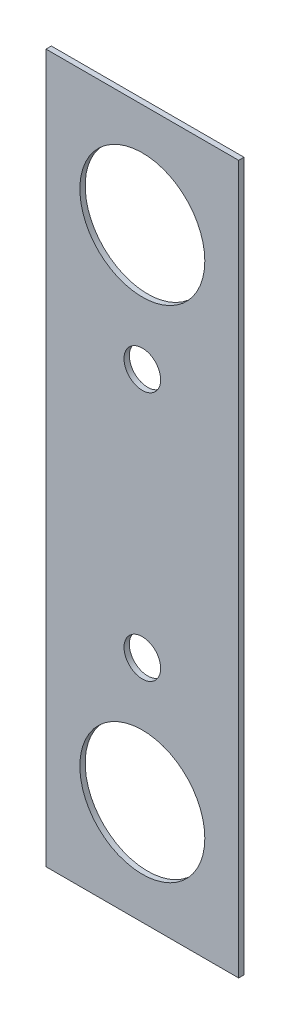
ISO-10303-21;
HEADER;
FILE_DESCRIPTION(('STEP AP214'),'2;1');
FILE_NAME('part.step','',(''),(''),'','','');
FILE_SCHEMA(('AUTOMOTIVE_DESIGN { 1 0 10303 214 1 1 1 1 }'));
ENDSEC;
DATA;
#1=APPLICATION_CONTEXT('core data for automotive mechanical design processes');
#2=APPLICATION_PROTOCOL_DEFINITION('international standard','automotive_design',2000,#1);
#3=PRODUCT_CONTEXT('',#1,'mechanical');
#4=PRODUCT('Part','Part','',(#3));
#5=PRODUCT_RELATED_PRODUCT_CATEGORY('part','',(#4));
#6=PRODUCT_DEFINITION_FORMATION('','',#4);
#7=PRODUCT_DEFINITION_CONTEXT('part definition',#1,'design');
#8=PRODUCT_DEFINITION('design','',#6,#7);
#9=PRODUCT_DEFINITION_SHAPE('','',#8);
#10=(LENGTH_UNIT() NAMED_UNIT(*) SI_UNIT(.MILLI.,.METRE.));
#11=(NAMED_UNIT(*) PLANE_ANGLE_UNIT() SI_UNIT($,.RADIAN.));
#12=(NAMED_UNIT(*) SI_UNIT($,.STERADIAN.) SOLID_ANGLE_UNIT());
#13=UNCERTAINTY_MEASURE_WITH_UNIT(LENGTH_MEASURE(1.E-05),#10,'distance_accuracy_value','');
#14=(GEOMETRIC_REPRESENTATION_CONTEXT(3) GLOBAL_UNCERTAINTY_ASSIGNED_CONTEXT((#13)) GLOBAL_UNIT_ASSIGNED_CONTEXT((#10,
#11,#12)) REPRESENTATION_CONTEXT('',''));
#15=CARTESIAN_POINT('',(0.,0.,0.));
#16=DIRECTION('',(0.,0.,1.));
#17=DIRECTION('',(1.,0.,0.));
#18=AXIS2_PLACEMENT_3D('',#15,#16,#17);
#19=CARTESIAN_POINT('',(14.6843750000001,-53.975,0.812800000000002));
#20=DIRECTION('',(0.,0.,1.));
#21=DIRECTION('',(1.,0.,0.));
#22=AXIS2_PLACEMENT_3D('',#19,#20,#21);
#23=PLANE('',#22);
#24=CARTESIAN_POINT('',(0.,19.05,0.812800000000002));
#25=DIRECTION('',(0.,0.,1.));
#26=DIRECTION('',(1.,0.,0.));
#27=AXIS2_PLACEMENT_3D('',#24,#25,#26);
#28=CIRCLE('',#27,2.794);
#29=CARTESIAN_POINT('',(2.794,19.05,0.812800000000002));
#30=VERTEX_POINT('',#29);
#31=EDGE_CURVE('E122',#30,#30,#28,.T.);
#32=ORIENTED_EDGE('',*,*,#31,.F.);
#33=EDGE_LOOP('',(#32));
#34=FACE_BOUND('',#33,.T.);
#35=CARTESIAN_POINT('',(0.,-38.1,0.812800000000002));
#36=DIRECTION('',(0.,0.,1.));
#37=DIRECTION('',(1.,0.,0.));
#38=AXIS2_PLACEMENT_3D('',#35,#36,#37);
#39=CIRCLE('',#38,9.525);
#40=CARTESIAN_POINT('',(9.525,-38.1,0.812800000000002));
#41=VERTEX_POINT('',#40);
#42=EDGE_CURVE('E101',#41,#41,#39,.T.);
#43=ORIENTED_EDGE('',*,*,#42,.F.);
#44=EDGE_LOOP('',(#43));
#45=FACE_BOUND('',#44,.T.);
#46=DIRECTION('',(1.,0.,0.));
#47=VECTOR('',#46,1.);
#48=CARTESIAN_POINT('',(-14.6843750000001,-53.975,0.812800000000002));
#49=LINE('',#48,#47);
#50=CARTESIAN_POINT('',(-14.6843750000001,-53.975,0.812800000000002));
#51=VERTEX_POINT('',#50);
#52=CARTESIAN_POINT('',(14.6843750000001,-53.975,0.812800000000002));
#53=VERTEX_POINT('',#52);
#54=EDGE_CURVE('E86',#51,#53,#49,.T.);
#55=ORIENTED_EDGE('',*,*,#54,.T.);
#56=DIRECTION('',(0.,1.,0.));
#57=VECTOR('',#56,1.);
#58=CARTESIAN_POINT('',(14.6843750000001,-53.975,0.812800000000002));
#59=LINE('',#58,#57);
#60=CARTESIAN_POINT('',(14.6843750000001,53.975,0.812800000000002));
#61=VERTEX_POINT('',#60);
#62=EDGE_CURVE('E81',#53,#61,#59,.T.);
#63=ORIENTED_EDGE('',*,*,#62,.T.);
#64=DIRECTION('',(-1.,0.,0.));
#65=VECTOR('',#64,1.);
#66=CARTESIAN_POINT('',(14.6843750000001,53.975,0.812800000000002));
#67=LINE('',#66,#65);
#68=CARTESIAN_POINT('',(-14.6843750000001,53.975,0.812800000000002));
#69=VERTEX_POINT('',#68);
#70=EDGE_CURVE('E84',#61,#69,#67,.T.);
#71=ORIENTED_EDGE('',*,*,#70,.T.);
#72=DIRECTION('',(0.,-1.,0.));
#73=VECTOR('',#72,1.);
#74=CARTESIAN_POINT('',(-14.6843750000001,53.975,0.812800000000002));
#75=LINE('',#74,#73);
#76=EDGE_CURVE('E51',#69,#51,#75,.T.);
#77=ORIENTED_EDGE('',*,*,#76,.T.);
#78=EDGE_LOOP('',(#55,#63,#71,#77));
#79=FACE_BOUND('',#78,.T.);
#80=CARTESIAN_POINT('',(0.,38.1,0.812800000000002));
#81=DIRECTION('',(0.,0.,1.));
#82=DIRECTION('',(1.,0.,0.));
#83=AXIS2_PLACEMENT_3D('',#80,#81,#82);
#84=CIRCLE('',#83,9.525);
#85=CARTESIAN_POINT('',(9.525,38.1,0.812800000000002));
#86=VERTEX_POINT('',#85);
#87=EDGE_CURVE('E116',#86,#86,#84,.T.);
#88=ORIENTED_EDGE('',*,*,#87,.F.);
#89=EDGE_LOOP('',(#88));
#90=FACE_BOUND('',#89,.T.);
#91=CARTESIAN_POINT('',(0.,-19.05,0.812800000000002));
#92=DIRECTION('',(0.,0.,1.));
#93=DIRECTION('',(1.,0.,0.));
#94=AXIS2_PLACEMENT_3D('',#91,#92,#93);
#95=CIRCLE('',#94,2.794);
#96=CARTESIAN_POINT('',(2.794,-19.05,0.812800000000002));
#97=VERTEX_POINT('',#96);
#98=EDGE_CURVE('E128',#97,#97,#95,.T.);
#99=ORIENTED_EDGE('',*,*,#98,.F.);
#100=EDGE_LOOP('',(#99));
#101=FACE_BOUND('',#100,.T.);
#102=ADVANCED_FACE('F34',(#34,#45,#79,#90,#101),#23,.T.);
#103=CARTESIAN_POINT('',(14.6843750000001,-53.975,0.));
#104=DIRECTION('',(0.,0.,1.));
#105=DIRECTION('',(1.,0.,0.));
#106=AXIS2_PLACEMENT_3D('',#103,#104,#105);
#107=PLANE('',#106);
#108=CARTESIAN_POINT('',(0.,19.05,0.));
#109=DIRECTION('',(0.,0.,1.));
#110=DIRECTION('',(1.,0.,0.));
#111=AXIS2_PLACEMENT_3D('',#108,#109,#110);
#112=CIRCLE('',#111,2.794);
#113=CARTESIAN_POINT('',(2.794,19.05,0.));
#114=VERTEX_POINT('',#113);
#115=EDGE_CURVE('E125',#114,#114,#112,.T.);
#116=ORIENTED_EDGE('',*,*,#115,.T.);
#117=EDGE_LOOP('',(#116));
#118=FACE_BOUND('',#117,.T.);
#119=CARTESIAN_POINT('',(0.,-38.1,0.));
#120=DIRECTION('',(0.,0.,1.));
#121=DIRECTION('',(1.,0.,0.));
#122=AXIS2_PLACEMENT_3D('',#119,#120,#121);
#123=CIRCLE('',#122,9.525);
#124=CARTESIAN_POINT('',(9.525,-38.1,0.));
#125=VERTEX_POINT('',#124);
#126=EDGE_CURVE('E113',#125,#125,#123,.T.);
#127=ORIENTED_EDGE('',*,*,#126,.T.);
#128=EDGE_LOOP('',(#127));
#129=FACE_BOUND('',#128,.T.);
#130=DIRECTION('',(1.,0.,0.));
#131=VECTOR('',#130,1.);
#132=CARTESIAN_POINT('',(-14.6843750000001,-53.975,0.));
#133=LINE('',#132,#131);
#134=CARTESIAN_POINT('',(-14.6843750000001,-53.975,0.));
#135=VERTEX_POINT('',#134);
#136=CARTESIAN_POINT('',(14.6843750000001,-53.975,0.));
#137=VERTEX_POINT('',#136);
#138=EDGE_CURVE('E98',#135,#137,#133,.T.);
#139=ORIENTED_EDGE('',*,*,#138,.F.);
#140=DIRECTION('',(0.,-1.,0.));
#141=VECTOR('',#140,1.);
#142=CARTESIAN_POINT('',(-14.6843750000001,53.975,0.));
#143=LINE('',#142,#141);
#144=CARTESIAN_POINT('',(-14.6843750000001,53.975,0.));
#145=VERTEX_POINT('',#144);
#146=EDGE_CURVE('E74',#145,#135,#143,.T.);
#147=ORIENTED_EDGE('',*,*,#146,.F.);
#148=DIRECTION('',(-1.,0.,0.));
#149=VECTOR('',#148,1.);
#150=CARTESIAN_POINT('',(14.6843750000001,53.975,0.));
#151=LINE('',#150,#149);
#152=CARTESIAN_POINT('',(14.6843750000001,53.975,0.));
#153=VERTEX_POINT('',#152);
#154=EDGE_CURVE('E68',#153,#145,#151,.T.);
#155=ORIENTED_EDGE('',*,*,#154,.F.);
#156=DIRECTION('',(0.,1.,0.));
#157=VECTOR('',#156,1.);
#158=CARTESIAN_POINT('',(14.6843750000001,-53.975,0.));
#159=LINE('',#158,#157);
#160=EDGE_CURVE('E90',#137,#153,#159,.T.);
#161=ORIENTED_EDGE('',*,*,#160,.F.);
#162=EDGE_LOOP('',(#139,#147,#155,#161));
#163=FACE_BOUND('',#162,.T.);
#164=CARTESIAN_POINT('',(0.,38.1,0.));
#165=DIRECTION('',(0.,0.,1.));
#166=DIRECTION('',(1.,0.,0.));
#167=AXIS2_PLACEMENT_3D('',#164,#165,#166);
#168=CIRCLE('',#167,9.525);
#169=CARTESIAN_POINT('',(9.525,38.1,0.));
#170=VERTEX_POINT('',#169);
#171=EDGE_CURVE('E119',#170,#170,#168,.T.);
#172=ORIENTED_EDGE('',*,*,#171,.T.);
#173=EDGE_LOOP('',(#172));
#174=FACE_BOUND('',#173,.T.);
#175=CARTESIAN_POINT('',(0.,-19.05,0.));
#176=DIRECTION('',(0.,0.,1.));
#177=DIRECTION('',(1.,0.,0.));
#178=AXIS2_PLACEMENT_3D('',#175,#176,#177);
#179=CIRCLE('',#178,2.794);
#180=CARTESIAN_POINT('',(2.794,-19.05,0.));
#181=VERTEX_POINT('',#180);
#182=EDGE_CURVE('E131',#181,#181,#179,.T.);
#183=ORIENTED_EDGE('',*,*,#182,.T.);
#184=EDGE_LOOP('',(#183));
#185=FACE_BOUND('',#184,.T.);
#186=ADVANCED_FACE('F109',(#118,#129,#163,#174,#185),#107,.F.);
#187=CARTESIAN_POINT('',(-14.6843750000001,-53.975,0.812800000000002));
#188=DIRECTION('',(0.,1.,0.));
#189=DIRECTION('',(0.,0.,1.));
#190=AXIS2_PLACEMENT_3D('',#187,#188,#189);
#191=PLANE('',#190);
#192=ORIENTED_EDGE('',*,*,#138,.T.);
#193=DIRECTION('',(0.,0.,-1.));
#194=VECTOR('',#193,1.);
#195=CARTESIAN_POINT('',(14.6843750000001,-53.975,0.812800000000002));
#196=LINE('',#195,#194);
#197=EDGE_CURVE('E11',#53,#137,#196,.T.);
#198=ORIENTED_EDGE('',*,*,#197,.F.);
#199=ORIENTED_EDGE('',*,*,#54,.F.);
#200=DIRECTION('',(0.,0.,-1.));
#201=VECTOR('',#200,1.);
#202=CARTESIAN_POINT('',(-14.6843750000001,-53.975,0.812800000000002));
#203=LINE('',#202,#201);
#204=EDGE_CURVE('E94',#51,#135,#203,.T.);
#205=ORIENTED_EDGE('',*,*,#204,.T.);
#206=EDGE_LOOP('',(#192,#198,#199,#205));
#207=FACE_BOUND('',#206,.T.);
#208=ADVANCED_FACE('F36',(#207),#191,.F.);
#209=CARTESIAN_POINT('',(14.6843750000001,-53.975,0.812800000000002));
#210=DIRECTION('',(-1.,0.,0.));
#211=DIRECTION('',(0.,0.,1.));
#212=AXIS2_PLACEMENT_3D('',#209,#210,#211);
#213=PLANE('',#212);
#214=ORIENTED_EDGE('',*,*,#160,.T.);
#215=DIRECTION('',(0.,0.,-1.));
#216=VECTOR('',#215,1.);
#217=CARTESIAN_POINT('',(14.6843750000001,53.975,0.812800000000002));
#218=LINE('',#217,#216);
#219=EDGE_CURVE('E43',#61,#153,#218,.T.);
#220=ORIENTED_EDGE('',*,*,#219,.F.);
#221=ORIENTED_EDGE('',*,*,#62,.F.);
#222=ORIENTED_EDGE('',*,*,#197,.T.);
#223=EDGE_LOOP('',(#214,#220,#221,#222));
#224=FACE_BOUND('',#223,.T.);
#225=ADVANCED_FACE('F89',(#224),#213,.F.);
#226=CARTESIAN_POINT('',(14.6843750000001,53.975,0.812800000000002));
#227=DIRECTION('',(0.,-1.,0.));
#228=DIRECTION('',(0.,0.,-1.));
#229=AXIS2_PLACEMENT_3D('',#226,#227,#228);
#230=PLANE('',#229);
#231=ORIENTED_EDGE('',*,*,#154,.T.);
#232=DIRECTION('',(0.,0.,-1.));
#233=VECTOR('',#232,1.);
#234=CARTESIAN_POINT('',(-14.6843750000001,53.975,0.812800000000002));
#235=LINE('',#234,#233);
#236=EDGE_CURVE('E91',#69,#145,#235,.T.);
#237=ORIENTED_EDGE('',*,*,#236,.F.);
#238=ORIENTED_EDGE('',*,*,#70,.F.);
#239=ORIENTED_EDGE('',*,*,#219,.T.);
#240=EDGE_LOOP('',(#231,#237,#238,#239));
#241=FACE_BOUND('',#240,.T.);
#242=ADVANCED_FACE('F92',(#241),#230,.F.);
#243=CARTESIAN_POINT('',(-14.6843750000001,53.975,0.812800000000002));
#244=DIRECTION('',(1.,0.,0.));
#245=DIRECTION('',(0.,0.,-1.));
#246=AXIS2_PLACEMENT_3D('',#243,#244,#245);
#247=PLANE('',#246);
#248=ORIENTED_EDGE('',*,*,#146,.T.);
#249=ORIENTED_EDGE('',*,*,#204,.F.);
#250=ORIENTED_EDGE('',*,*,#76,.F.);
#251=ORIENTED_EDGE('',*,*,#236,.T.);
#252=EDGE_LOOP('',(#248,#249,#250,#251));
#253=FACE_BOUND('',#252,.T.);
#254=ADVANCED_FACE('F106',(#253),#247,.F.);
#255=CARTESIAN_POINT('',(0.,-38.1,0.812800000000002));
#256=DIRECTION('',(0.,0.,-1.));
#257=DIRECTION('',(-1.,0.,0.));
#258=AXIS2_PLACEMENT_3D('',#255,#256,#257);
#259=CYLINDRICAL_SURFACE('',#258,9.525);
#260=ORIENTED_EDGE('',*,*,#42,.T.);
#261=EDGE_LOOP('',(#260));
#262=FACE_BOUND('',#261,.T.);
#263=ORIENTED_EDGE('',*,*,#126,.F.);
#264=EDGE_LOOP('',(#263));
#265=FACE_BOUND('',#264,.T.);
#266=ADVANCED_FACE('F151',(#262,#265),#259,.F.);
#267=CARTESIAN_POINT('',(0.,38.1,0.812800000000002));
#268=DIRECTION('',(0.,0.,-1.));
#269=DIRECTION('',(-1.,0.,0.));
#270=AXIS2_PLACEMENT_3D('',#267,#268,#269);
#271=CYLINDRICAL_SURFACE('',#270,9.525);
#272=ORIENTED_EDGE('',*,*,#87,.T.);
#273=EDGE_LOOP('',(#272));
#274=FACE_BOUND('',#273,.T.);
#275=ORIENTED_EDGE('',*,*,#171,.F.);
#276=EDGE_LOOP('',(#275));
#277=FACE_BOUND('',#276,.T.);
#278=ADVANCED_FACE('F186',(#274,#277),#271,.F.);
#279=CARTESIAN_POINT('',(0.,19.05,0.812800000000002));
#280=DIRECTION('',(0.,0.,-1.));
#281=DIRECTION('',(-1.,0.,0.));
#282=AXIS2_PLACEMENT_3D('',#279,#280,#281);
#283=CYLINDRICAL_SURFACE('',#282,2.794);
#284=ORIENTED_EDGE('',*,*,#31,.T.);
#285=EDGE_LOOP('',(#284));
#286=FACE_BOUND('',#285,.T.);
#287=ORIENTED_EDGE('',*,*,#115,.F.);
#288=EDGE_LOOP('',(#287));
#289=FACE_BOUND('',#288,.T.);
#290=ADVANCED_FACE('F193',(#286,#289),#283,.F.);
#291=CARTESIAN_POINT('',(0.,-19.05,0.812800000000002));
#292=DIRECTION('',(0.,0.,-1.));
#293=DIRECTION('',(-1.,0.,0.));
#294=AXIS2_PLACEMENT_3D('',#291,#292,#293);
#295=CYLINDRICAL_SURFACE('',#294,2.794);
#296=ORIENTED_EDGE('',*,*,#98,.T.);
#297=EDGE_LOOP('',(#296));
#298=FACE_BOUND('',#297,.T.);
#299=ORIENTED_EDGE('',*,*,#182,.F.);
#300=EDGE_LOOP('',(#299));
#301=FACE_BOUND('',#300,.T.);
#302=ADVANCED_FACE('F137',(#298,#301),#295,.F.);
#303=CLOSED_SHELL('',(#102,#186,#208,#225,#242,#254,#266,#278,#290,#302));
#304=MANIFOLD_SOLID_BREP('B2',#303);
#305=ADVANCED_BREP_SHAPE_REPRESENTATION('',(#18,#304),#14);
#306=SHAPE_DEFINITION_REPRESENTATION(#9,#305);
ENDSEC;
END-ISO-10303-21;
